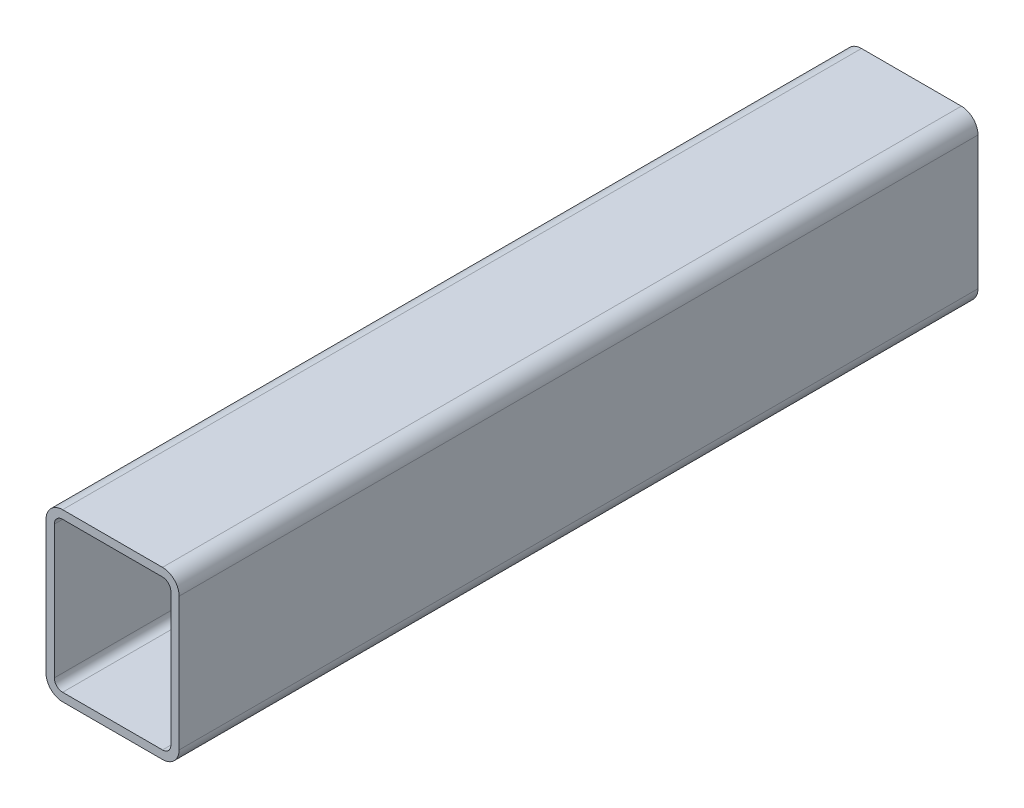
ISO-10303-21;
HEADER;
FILE_DESCRIPTION(('STEP AP214'),'2;1');
FILE_NAME('part.step','',(''),(''),'','','');
FILE_SCHEMA(('AUTOMOTIVE_DESIGN { 1 0 10303 214 1 1 1 1 }'));
ENDSEC;
DATA;
#1=APPLICATION_CONTEXT('core data for automotive mechanical design processes');
#2=APPLICATION_PROTOCOL_DEFINITION('international standard','automotive_design',2000,#1);
#3=PRODUCT_CONTEXT('',#1,'mechanical');
#4=PRODUCT('Part','Part','',(#3));
#5=PRODUCT_RELATED_PRODUCT_CATEGORY('part','',(#4));
#6=PRODUCT_DEFINITION_FORMATION('','',#4);
#7=PRODUCT_DEFINITION_CONTEXT('part definition',#1,'design');
#8=PRODUCT_DEFINITION('design','',#6,#7);
#9=PRODUCT_DEFINITION_SHAPE('','',#8);
#10=(LENGTH_UNIT() NAMED_UNIT(*) SI_UNIT(.MILLI.,.METRE.));
#11=(NAMED_UNIT(*) PLANE_ANGLE_UNIT() SI_UNIT($,.RADIAN.));
#12=(NAMED_UNIT(*) SI_UNIT($,.STERADIAN.) SOLID_ANGLE_UNIT());
#13=UNCERTAINTY_MEASURE_WITH_UNIT(LENGTH_MEASURE(1.E-05),#10,'distance_accuracy_value','');
#14=(GEOMETRIC_REPRESENTATION_CONTEXT(3) GLOBAL_UNCERTAINTY_ASSIGNED_CONTEXT((#13)) GLOBAL_UNIT_ASSIGNED_CONTEXT((#10,
#11,#12)) REPRESENTATION_CONTEXT('',''));
#15=CARTESIAN_POINT('',(0.,0.,0.));
#16=DIRECTION('',(0.,0.,1.));
#17=DIRECTION('',(1.,0.,0.));
#18=AXIS2_PLACEMENT_3D('',#15,#16,#17);
#19=CARTESIAN_POINT('',(6.35,57.15,304.8));
#20=DIRECTION('',(0.,0.,1.));
#21=DIRECTION('',(1.,0.,0.));
#22=AXIS2_PLACEMENT_3D('',#19,#20,#21);
#23=PLANE('',#22);
#24=CARTESIAN_POINT('',(6.35,57.15,304.8));
#25=DIRECTION('',(0.,0.,1.));
#26=DIRECTION('',(1.,0.,0.));
#27=AXIS2_PLACEMENT_3D('',#24,#25,#26);
#28=CIRCLE('',#27,6.35);
#29=CARTESIAN_POINT('',(6.35,63.5,304.8));
#30=VERTEX_POINT('',#29);
#31=CARTESIAN_POINT('',(0.,57.15,304.8));
#32=VERTEX_POINT('',#31);
#33=EDGE_CURVE('E211',#30,#32,#28,.T.);
#34=ORIENTED_EDGE('',*,*,#33,.T.);
#35=DIRECTION('',(0.,-1.,0.));
#36=VECTOR('',#35,1.);
#37=CARTESIAN_POINT('',(0.,6.35,304.8));
#38=LINE('',#37,#36);
#39=CARTESIAN_POINT('',(0.,6.35,304.8));
#40=VERTEX_POINT('',#39);
#41=EDGE_CURVE('E214',#32,#40,#38,.T.);
#42=ORIENTED_EDGE('',*,*,#41,.T.);
#43=CARTESIAN_POINT('',(6.35,6.35,304.8));
#44=DIRECTION('',(0.,0.,1.));
#45=DIRECTION('',(1.,0.,0.));
#46=AXIS2_PLACEMENT_3D('',#43,#44,#45);
#47=CIRCLE('',#46,6.35);
#48=CARTESIAN_POINT('',(6.35,0.,304.8));
#49=VERTEX_POINT('',#48);
#50=EDGE_CURVE('E217',#40,#49,#47,.T.);
#51=ORIENTED_EDGE('',*,*,#50,.T.);
#52=DIRECTION('',(1.,0.,0.));
#53=VECTOR('',#52,1.);
#54=CARTESIAN_POINT('',(44.45,0.,304.8));
#55=LINE('',#54,#53);
#56=CARTESIAN_POINT('',(44.45,0.,304.8));
#57=VERTEX_POINT('',#56);
#58=EDGE_CURVE('E219',#49,#57,#55,.T.);
#59=ORIENTED_EDGE('',*,*,#58,.T.);
#60=CARTESIAN_POINT('',(44.45,6.35,304.8));
#61=DIRECTION('',(0.,0.,1.));
#62=DIRECTION('',(1.,0.,0.));
#63=AXIS2_PLACEMENT_3D('',#60,#61,#62);
#64=CIRCLE('',#63,6.35);
#65=CARTESIAN_POINT('',(50.8,6.35,304.8));
#66=VERTEX_POINT('',#65);
#67=EDGE_CURVE('E221',#57,#66,#64,.T.);
#68=ORIENTED_EDGE('',*,*,#67,.T.);
#69=DIRECTION('',(0.,1.,0.));
#70=VECTOR('',#69,1.);
#71=CARTESIAN_POINT('',(50.8,57.15,304.8));
#72=LINE('',#71,#70);
#73=CARTESIAN_POINT('',(50.8,57.15,304.8));
#74=VERTEX_POINT('',#73);
#75=EDGE_CURVE('E223',#66,#74,#72,.T.);
#76=ORIENTED_EDGE('',*,*,#75,.T.);
#77=CARTESIAN_POINT('',(44.45,57.15,304.8));
#78=DIRECTION('',(0.,0.,1.));
#79=DIRECTION('',(1.,0.,0.));
#80=AXIS2_PLACEMENT_3D('',#77,#78,#79);
#81=CIRCLE('',#80,6.35);
#82=CARTESIAN_POINT('',(44.45,63.5,304.8));
#83=VERTEX_POINT('',#82);
#84=EDGE_CURVE('E225',#74,#83,#81,.T.);
#85=ORIENTED_EDGE('',*,*,#84,.T.);
#86=DIRECTION('',(-1.,0.,0.));
#87=VECTOR('',#86,1.);
#88=CARTESIAN_POINT('',(6.35,63.5,304.8));
#89=LINE('',#88,#87);
#90=EDGE_CURVE('E227',#83,#30,#89,.T.);
#91=ORIENTED_EDGE('',*,*,#90,.T.);
#92=EDGE_LOOP('',(#34,#42,#51,#59,#68,#76,#85,#91));
#93=FACE_BOUND('',#92,.T.);
#94=DIRECTION('',(0.,-1.,0.));
#95=VECTOR('',#94,1.);
#96=CARTESIAN_POINT('',(3.175,6.35,304.8));
#97=LINE('',#96,#95);
#98=CARTESIAN_POINT('',(3.175,57.15,304.8));
#99=VERTEX_POINT('',#98);
#100=CARTESIAN_POINT('',(3.175,6.35,304.8));
#101=VERTEX_POINT('',#100);
#102=EDGE_CURVE('E154',#99,#101,#97,.T.);
#103=ORIENTED_EDGE('',*,*,#102,.F.);
#104=CARTESIAN_POINT('',(6.35,57.15,304.8));
#105=DIRECTION('',(0.,0.,1.));
#106=DIRECTION('',(1.,0.,0.));
#107=AXIS2_PLACEMENT_3D('',#104,#105,#106);
#108=CIRCLE('',#107,3.17499999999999);
#109=CARTESIAN_POINT('',(6.35,60.325,304.8));
#110=VERTEX_POINT('',#109);
#111=EDGE_CURVE('E146',#110,#99,#108,.T.);
#112=ORIENTED_EDGE('',*,*,#111,.F.);
#113=DIRECTION('',(-1.,0.,0.));
#114=VECTOR('',#113,1.);
#115=CARTESIAN_POINT('',(6.35,60.325,304.8));
#116=LINE('',#115,#114);
#117=CARTESIAN_POINT('',(44.45,60.325,304.8));
#118=VERTEX_POINT('',#117);
#119=EDGE_CURVE('E179',#118,#110,#116,.T.);
#120=ORIENTED_EDGE('',*,*,#119,.F.);
#121=CARTESIAN_POINT('',(44.45,57.15,304.8));
#122=DIRECTION('',(0.,0.,1.));
#123=DIRECTION('',(1.,0.,0.));
#124=AXIS2_PLACEMENT_3D('',#121,#122,#123);
#125=CIRCLE('',#124,3.17499999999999);
#126=CARTESIAN_POINT('',(47.625,57.15,304.8));
#127=VERTEX_POINT('',#126);
#128=EDGE_CURVE('E177',#127,#118,#125,.T.);
#129=ORIENTED_EDGE('',*,*,#128,.F.);
#130=DIRECTION('',(0.,1.,0.));
#131=VECTOR('',#130,1.);
#132=CARTESIAN_POINT('',(47.625,57.15,304.8));
#133=LINE('',#132,#131);
#134=CARTESIAN_POINT('',(47.625,6.35,304.8));
#135=VERTEX_POINT('',#134);
#136=EDGE_CURVE('E175',#135,#127,#133,.T.);
#137=ORIENTED_EDGE('',*,*,#136,.F.);
#138=CARTESIAN_POINT('',(44.45,6.35,304.8));
#139=DIRECTION('',(0.,0.,1.));
#140=DIRECTION('',(1.,0.,0.));
#141=AXIS2_PLACEMENT_3D('',#138,#139,#140);
#142=CIRCLE('',#141,3.175);
#143=CARTESIAN_POINT('',(44.45,3.175,304.8));
#144=VERTEX_POINT('',#143);
#145=EDGE_CURVE('E173',#144,#135,#142,.T.);
#146=ORIENTED_EDGE('',*,*,#145,.F.);
#147=DIRECTION('',(1.,0.,0.));
#148=VECTOR('',#147,1.);
#149=CARTESIAN_POINT('',(44.45,3.175,304.8));
#150=LINE('',#149,#148);
#151=CARTESIAN_POINT('',(6.35,3.175,304.8));
#152=VERTEX_POINT('',#151);
#153=EDGE_CURVE('E169',#152,#144,#150,.T.);
#154=ORIENTED_EDGE('',*,*,#153,.F.);
#155=CARTESIAN_POINT('',(6.35,6.35,304.8));
#156=DIRECTION('',(0.,0.,1.));
#157=DIRECTION('',(1.,0.,0.));
#158=AXIS2_PLACEMENT_3D('',#155,#156,#157);
#159=CIRCLE('',#158,3.175);
#160=EDGE_CURVE('E167',#101,#152,#159,.T.);
#161=ORIENTED_EDGE('',*,*,#160,.F.);
#162=EDGE_LOOP('',(#103,#112,#120,#129,#137,#146,#154,#161));
#163=FACE_BOUND('',#162,.T.);
#164=ADVANCED_FACE('F33',(#93,#163),#23,.T.);
#165=CARTESIAN_POINT('',(6.35,57.15,0.));
#166=DIRECTION('',(0.,0.,1.));
#167=DIRECTION('',(1.,0.,0.));
#168=AXIS2_PLACEMENT_3D('',#165,#166,#167);
#169=PLANE('',#168);
#170=CARTESIAN_POINT('',(6.35,57.15,0.));
#171=DIRECTION('',(0.,0.,1.));
#172=DIRECTION('',(1.,0.,0.));
#173=AXIS2_PLACEMENT_3D('',#170,#171,#172);
#174=CIRCLE('',#173,6.35);
#175=CARTESIAN_POINT('',(6.35,63.5,0.));
#176=VERTEX_POINT('',#175);
#177=CARTESIAN_POINT('',(0.,57.15,0.));
#178=VERTEX_POINT('',#177);
#179=EDGE_CURVE('E162',#176,#178,#174,.T.);
#180=ORIENTED_EDGE('',*,*,#179,.F.);
#181=DIRECTION('',(-1.,0.,0.));
#182=VECTOR('',#181,1.);
#183=CARTESIAN_POINT('',(6.35,63.5,0.));
#184=LINE('',#183,#182);
#185=CARTESIAN_POINT('',(44.45,63.5,0.));
#186=VERTEX_POINT('',#185);
#187=EDGE_CURVE('E215',#186,#176,#184,.T.);
#188=ORIENTED_EDGE('',*,*,#187,.F.);
#189=CARTESIAN_POINT('',(44.45,57.15,0.));
#190=DIRECTION('',(0.,0.,1.));
#191=DIRECTION('',(1.,0.,0.));
#192=AXIS2_PLACEMENT_3D('',#189,#190,#191);
#193=CIRCLE('',#192,6.35);
#194=CARTESIAN_POINT('',(50.8,57.15,0.));
#195=VERTEX_POINT('',#194);
#196=EDGE_CURVE('E242',#195,#186,#193,.T.);
#197=ORIENTED_EDGE('',*,*,#196,.F.);
#198=DIRECTION('',(0.,1.,0.));
#199=VECTOR('',#198,1.);
#200=CARTESIAN_POINT('',(50.8,57.15,0.));
#201=LINE('',#200,#199);
#202=CARTESIAN_POINT('',(50.8,6.35,0.));
#203=VERTEX_POINT('',#202);
#204=EDGE_CURVE('E240',#203,#195,#201,.T.);
#205=ORIENTED_EDGE('',*,*,#204,.F.);
#206=CARTESIAN_POINT('',(44.45,6.35,0.));
#207=DIRECTION('',(0.,0.,1.));
#208=DIRECTION('',(1.,0.,0.));
#209=AXIS2_PLACEMENT_3D('',#206,#207,#208);
#210=CIRCLE('',#209,6.35);
#211=CARTESIAN_POINT('',(44.45,0.,0.));
#212=VERTEX_POINT('',#211);
#213=EDGE_CURVE('E238',#212,#203,#210,.T.);
#214=ORIENTED_EDGE('',*,*,#213,.F.);
#215=DIRECTION('',(1.,0.,0.));
#216=VECTOR('',#215,1.);
#217=CARTESIAN_POINT('',(44.45,0.,0.));
#218=LINE('',#217,#216);
#219=CARTESIAN_POINT('',(6.35,0.,0.));
#220=VERTEX_POINT('',#219);
#221=EDGE_CURVE('E236',#220,#212,#218,.T.);
#222=ORIENTED_EDGE('',*,*,#221,.F.);
#223=CARTESIAN_POINT('',(6.35,6.35,0.));
#224=DIRECTION('',(0.,0.,1.));
#225=DIRECTION('',(1.,0.,0.));
#226=AXIS2_PLACEMENT_3D('',#223,#224,#225);
#227=CIRCLE('',#226,6.35);
#228=CARTESIAN_POINT('',(0.,6.35,0.));
#229=VERTEX_POINT('',#228);
#230=EDGE_CURVE('E234',#229,#220,#227,.T.);
#231=ORIENTED_EDGE('',*,*,#230,.F.);
#232=DIRECTION('',(0.,-1.,0.));
#233=VECTOR('',#232,1.);
#234=CARTESIAN_POINT('',(0.,6.35,0.));
#235=LINE('',#234,#233);
#236=EDGE_CURVE('E232',#178,#229,#235,.T.);
#237=ORIENTED_EDGE('',*,*,#236,.F.);
#238=EDGE_LOOP('',(#180,#188,#197,#205,#214,#222,#231,#237));
#239=FACE_BOUND('',#238,.T.);
#240=CARTESIAN_POINT('',(6.35,57.15,0.));
#241=DIRECTION('',(0.,0.,1.));
#242=DIRECTION('',(1.,0.,0.));
#243=AXIS2_PLACEMENT_3D('',#240,#241,#242);
#244=CIRCLE('',#243,3.17499999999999);
#245=CARTESIAN_POINT('',(6.35,60.325,0.));
#246=VERTEX_POINT('',#245);
#247=CARTESIAN_POINT('',(3.175,57.15,0.));
#248=VERTEX_POINT('',#247);
#249=EDGE_CURVE('E56',#246,#248,#244,.T.);
#250=ORIENTED_EDGE('',*,*,#249,.T.);
#251=DIRECTION('',(0.,-1.,0.));
#252=VECTOR('',#251,1.);
#253=CARTESIAN_POINT('',(3.175,6.35,0.));
#254=LINE('',#253,#252);
#255=CARTESIAN_POINT('',(3.175,6.35,0.));
#256=VERTEX_POINT('',#255);
#257=EDGE_CURVE('E161',#248,#256,#254,.T.);
#258=ORIENTED_EDGE('',*,*,#257,.T.);
#259=CARTESIAN_POINT('',(6.35,6.35,0.));
#260=DIRECTION('',(0.,0.,1.));
#261=DIRECTION('',(1.,0.,0.));
#262=AXIS2_PLACEMENT_3D('',#259,#260,#261);
#263=CIRCLE('',#262,3.175);
#264=CARTESIAN_POINT('',(6.35,3.175,0.));
#265=VERTEX_POINT('',#264);
#266=EDGE_CURVE('E183',#256,#265,#263,.T.);
#267=ORIENTED_EDGE('',*,*,#266,.T.);
#268=DIRECTION('',(1.,0.,0.));
#269=VECTOR('',#268,1.);
#270=CARTESIAN_POINT('',(44.45,3.175,0.));
#271=LINE('',#270,#269);
#272=CARTESIAN_POINT('',(44.45,3.175,0.));
#273=VERTEX_POINT('',#272);
#274=EDGE_CURVE('E186',#265,#273,#271,.T.);
#275=ORIENTED_EDGE('',*,*,#274,.T.);
#276=CARTESIAN_POINT('',(44.45,6.35,0.));
#277=DIRECTION('',(0.,0.,1.));
#278=DIRECTION('',(1.,0.,0.));
#279=AXIS2_PLACEMENT_3D('',#276,#277,#278);
#280=CIRCLE('',#279,3.175);
#281=CARTESIAN_POINT('',(47.625,6.35,0.));
#282=VERTEX_POINT('',#281);
#283=EDGE_CURVE('E189',#273,#282,#280,.T.);
#284=ORIENTED_EDGE('',*,*,#283,.T.);
#285=DIRECTION('',(0.,1.,0.));
#286=VECTOR('',#285,1.);
#287=CARTESIAN_POINT('',(47.625,57.15,0.));
#288=LINE('',#287,#286);
#289=CARTESIAN_POINT('',(47.625,57.15,0.));
#290=VERTEX_POINT('',#289);
#291=EDGE_CURVE('E192',#282,#290,#288,.T.);
#292=ORIENTED_EDGE('',*,*,#291,.T.);
#293=CARTESIAN_POINT('',(44.45,57.15,0.));
#294=DIRECTION('',(0.,0.,1.));
#295=DIRECTION('',(1.,0.,0.));
#296=AXIS2_PLACEMENT_3D('',#293,#294,#295);
#297=CIRCLE('',#296,3.17499999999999);
#298=CARTESIAN_POINT('',(44.45,60.325,0.));
#299=VERTEX_POINT('',#298);
#300=EDGE_CURVE('E195',#290,#299,#297,.T.);
#301=ORIENTED_EDGE('',*,*,#300,.T.);
#302=DIRECTION('',(-1.,0.,0.));
#303=VECTOR('',#302,1.);
#304=CARTESIAN_POINT('',(6.35,60.325,0.));
#305=LINE('',#304,#303);
#306=EDGE_CURVE('E155',#299,#246,#305,.T.);
#307=ORIENTED_EDGE('',*,*,#306,.T.);
#308=EDGE_LOOP('',(#250,#258,#267,#275,#284,#292,#301,#307));
#309=FACE_BOUND('',#308,.T.);
#310=ADVANCED_FACE('F272',(#239,#309),#169,.F.);
#311=CARTESIAN_POINT('',(6.35,57.15,304.8));
#312=DIRECTION('',(0.,0.,-1.));
#313=DIRECTION('',(-1.,0.,0.));
#314=AXIS2_PLACEMENT_3D('',#311,#312,#313);
#315=CYLINDRICAL_SURFACE('',#314,6.35);
#316=ORIENTED_EDGE('',*,*,#179,.T.);
#317=DIRECTION('',(0.,0.,-1.));
#318=VECTOR('',#317,1.);
#319=CARTESIAN_POINT('',(0.,57.15,304.8));
#320=LINE('',#319,#318);
#321=EDGE_CURVE('E11',#32,#178,#320,.T.);
#322=ORIENTED_EDGE('',*,*,#321,.F.);
#323=ORIENTED_EDGE('',*,*,#33,.F.);
#324=DIRECTION('',(0.,0.,-1.));
#325=VECTOR('',#324,1.);
#326=CARTESIAN_POINT('',(6.35,63.5,304.8));
#327=LINE('',#326,#325);
#328=EDGE_CURVE('E229',#30,#176,#327,.T.);
#329=ORIENTED_EDGE('',*,*,#328,.T.);
#330=EDGE_LOOP('',(#316,#322,#323,#329));
#331=FACE_BOUND('',#330,.T.);
#332=ADVANCED_FACE('F35',(#331),#315,.T.);
#333=CARTESIAN_POINT('',(0.,6.35,304.8));
#334=DIRECTION('',(1.,0.,0.));
#335=DIRECTION('',(0.,0.,-1.));
#336=AXIS2_PLACEMENT_3D('',#333,#334,#335);
#337=PLANE('',#336);
#338=ORIENTED_EDGE('',*,*,#236,.T.);
#339=DIRECTION('',(0.,0.,-1.));
#340=VECTOR('',#339,1.);
#341=CARTESIAN_POINT('',(0.,6.35,304.8));
#342=LINE('',#341,#340);
#343=EDGE_CURVE('E41',#40,#229,#342,.T.);
#344=ORIENTED_EDGE('',*,*,#343,.F.);
#345=ORIENTED_EDGE('',*,*,#41,.F.);
#346=ORIENTED_EDGE('',*,*,#321,.T.);
#347=EDGE_LOOP('',(#338,#344,#345,#346));
#348=FACE_BOUND('',#347,.T.);
#349=ADVANCED_FACE('F289',(#348),#337,.F.);
#350=CARTESIAN_POINT('',(6.35,6.35,304.8));
#351=DIRECTION('',(0.,0.,-1.));
#352=DIRECTION('',(-1.,0.,0.));
#353=AXIS2_PLACEMENT_3D('',#350,#351,#352);
#354=CYLINDRICAL_SURFACE('',#353,6.35);
#355=ORIENTED_EDGE('',*,*,#230,.T.);
#356=DIRECTION('',(0.,0.,-1.));
#357=VECTOR('',#356,1.);
#358=CARTESIAN_POINT('',(6.35,0.,304.8));
#359=LINE('',#358,#357);
#360=EDGE_CURVE('E259',#49,#220,#359,.T.);
#361=ORIENTED_EDGE('',*,*,#360,.F.);
#362=ORIENTED_EDGE('',*,*,#50,.F.);
#363=ORIENTED_EDGE('',*,*,#343,.T.);
#364=EDGE_LOOP('',(#355,#361,#362,#363));
#365=FACE_BOUND('',#364,.T.);
#366=ADVANCED_FACE('F266',(#365),#354,.T.);
#367=CARTESIAN_POINT('',(44.45,0.,304.8));
#368=DIRECTION('',(0.,1.,0.));
#369=DIRECTION('',(0.,0.,1.));
#370=AXIS2_PLACEMENT_3D('',#367,#368,#369);
#371=PLANE('',#370);
#372=ORIENTED_EDGE('',*,*,#221,.T.);
#373=DIRECTION('',(0.,0.,-1.));
#374=VECTOR('',#373,1.);
#375=CARTESIAN_POINT('',(44.45,0.,304.8));
#376=LINE('',#375,#374);
#377=EDGE_CURVE('E256',#57,#212,#376,.T.);
#378=ORIENTED_EDGE('',*,*,#377,.F.);
#379=ORIENTED_EDGE('',*,*,#58,.F.);
#380=ORIENTED_EDGE('',*,*,#360,.T.);
#381=EDGE_LOOP('',(#372,#378,#379,#380));
#382=FACE_BOUND('',#381,.T.);
#383=ADVANCED_FACE('F278',(#382),#371,.F.);
#384=CARTESIAN_POINT('',(44.45,6.35,304.8));
#385=DIRECTION('',(0.,0.,-1.));
#386=DIRECTION('',(-1.,0.,0.));
#387=AXIS2_PLACEMENT_3D('',#384,#385,#386);
#388=CYLINDRICAL_SURFACE('',#387,6.35);
#389=ORIENTED_EDGE('',*,*,#213,.T.);
#390=DIRECTION('',(0.,0.,-1.));
#391=VECTOR('',#390,1.);
#392=CARTESIAN_POINT('',(50.8,6.35,304.8));
#393=LINE('',#392,#391);
#394=EDGE_CURVE('E253',#66,#203,#393,.T.);
#395=ORIENTED_EDGE('',*,*,#394,.F.);
#396=ORIENTED_EDGE('',*,*,#67,.F.);
#397=ORIENTED_EDGE('',*,*,#377,.T.);
#398=EDGE_LOOP('',(#389,#395,#396,#397));
#399=FACE_BOUND('',#398,.T.);
#400=ADVANCED_FACE('F282',(#399),#388,.T.);
#401=CARTESIAN_POINT('',(50.8,57.15,304.8));
#402=DIRECTION('',(-1.,0.,0.));
#403=DIRECTION('',(0.,0.,1.));
#404=AXIS2_PLACEMENT_3D('',#401,#402,#403);
#405=PLANE('',#404);
#406=ORIENTED_EDGE('',*,*,#204,.T.);
#407=DIRECTION('',(0.,0.,-1.));
#408=VECTOR('',#407,1.);
#409=CARTESIAN_POINT('',(50.8,57.15,304.8));
#410=LINE('',#409,#408);
#411=EDGE_CURVE('E250',#74,#195,#410,.T.);
#412=ORIENTED_EDGE('',*,*,#411,.F.);
#413=ORIENTED_EDGE('',*,*,#75,.F.);
#414=ORIENTED_EDGE('',*,*,#394,.T.);
#415=EDGE_LOOP('',(#406,#412,#413,#414));
#416=FACE_BOUND('',#415,.T.);
#417=ADVANCED_FACE('F302',(#416),#405,.F.);
#418=CARTESIAN_POINT('',(44.45,57.15,304.8));
#419=DIRECTION('',(0.,0.,-1.));
#420=DIRECTION('',(-1.,0.,0.));
#421=AXIS2_PLACEMENT_3D('',#418,#419,#420);
#422=CYLINDRICAL_SURFACE('',#421,6.35);
#423=ORIENTED_EDGE('',*,*,#196,.T.);
#424=DIRECTION('',(0.,0.,-1.));
#425=VECTOR('',#424,1.);
#426=CARTESIAN_POINT('',(44.45,63.5,304.8));
#427=LINE('',#426,#425);
#428=EDGE_CURVE('E247',#83,#186,#427,.T.);
#429=ORIENTED_EDGE('',*,*,#428,.F.);
#430=ORIENTED_EDGE('',*,*,#84,.F.);
#431=ORIENTED_EDGE('',*,*,#411,.T.);
#432=EDGE_LOOP('',(#423,#429,#430,#431));
#433=FACE_BOUND('',#432,.T.);
#434=ADVANCED_FACE('F300',(#433),#422,.T.);
#435=CARTESIAN_POINT('',(6.35,63.5,304.8));
#436=DIRECTION('',(0.,-1.,0.));
#437=DIRECTION('',(0.,0.,-1.));
#438=AXIS2_PLACEMENT_3D('',#435,#436,#437);
#439=PLANE('',#438);
#440=ORIENTED_EDGE('',*,*,#187,.T.);
#441=ORIENTED_EDGE('',*,*,#328,.F.);
#442=ORIENTED_EDGE('',*,*,#90,.F.);
#443=ORIENTED_EDGE('',*,*,#428,.T.);
#444=EDGE_LOOP('',(#440,#441,#442,#443));
#445=FACE_BOUND('',#444,.T.);
#446=ADVANCED_FACE('F295',(#445),#439,.F.);
#447=CARTESIAN_POINT('',(6.35,57.15,304.8));
#448=DIRECTION('',(0.,0.,-1.));
#449=DIRECTION('',(-1.,0.,0.));
#450=AXIS2_PLACEMENT_3D('',#447,#448,#449);
#451=CYLINDRICAL_SURFACE('',#450,3.17499999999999);
#452=ORIENTED_EDGE('',*,*,#249,.F.);
#453=DIRECTION('',(0.,0.,-1.));
#454=VECTOR('',#453,1.);
#455=CARTESIAN_POINT('',(6.35,60.325,304.8));
#456=LINE('',#455,#454);
#457=EDGE_CURVE('E150',#110,#246,#456,.T.);
#458=ORIENTED_EDGE('',*,*,#457,.F.);
#459=ORIENTED_EDGE('',*,*,#111,.T.);
#460=DIRECTION('',(0.,0.,-1.));
#461=VECTOR('',#460,1.);
#462=CARTESIAN_POINT('',(3.175,57.15,304.8));
#463=LINE('',#462,#461);
#464=EDGE_CURVE('E149',#99,#248,#463,.T.);
#465=ORIENTED_EDGE('',*,*,#464,.T.);
#466=EDGE_LOOP('',(#452,#458,#459,#465));
#467=FACE_BOUND('',#466,.T.);
#468=ADVANCED_FACE('F148',(#467),#451,.F.);
#469=CARTESIAN_POINT('',(3.175,6.35,304.8));
#470=DIRECTION('',(1.,0.,0.));
#471=DIRECTION('',(0.,0.,-1.));
#472=AXIS2_PLACEMENT_3D('',#469,#470,#471);
#473=PLANE('',#472);
#474=ORIENTED_EDGE('',*,*,#257,.F.);
#475=ORIENTED_EDGE('',*,*,#464,.F.);
#476=ORIENTED_EDGE('',*,*,#102,.T.);
#477=DIRECTION('',(0.,0.,-1.));
#478=VECTOR('',#477,1.);
#479=CARTESIAN_POINT('',(3.175,6.35,304.8));
#480=LINE('',#479,#478);
#481=EDGE_CURVE('E163',#101,#256,#480,.T.);
#482=ORIENTED_EDGE('',*,*,#481,.T.);
#483=EDGE_LOOP('',(#474,#475,#476,#482));
#484=FACE_BOUND('',#483,.T.);
#485=ADVANCED_FACE('F158',(#484),#473,.T.);
#486=CARTESIAN_POINT('',(6.35,6.35,304.8));
#487=DIRECTION('',(0.,0.,-1.));
#488=DIRECTION('',(-1.,0.,0.));
#489=AXIS2_PLACEMENT_3D('',#486,#487,#488);
#490=CYLINDRICAL_SURFACE('',#489,3.175);
#491=ORIENTED_EDGE('',*,*,#266,.F.);
#492=ORIENTED_EDGE('',*,*,#481,.F.);
#493=ORIENTED_EDGE('',*,*,#160,.T.);
#494=DIRECTION('',(0.,0.,-1.));
#495=VECTOR('',#494,1.);
#496=CARTESIAN_POINT('',(6.35,3.175,304.8));
#497=LINE('',#496,#495);
#498=EDGE_CURVE('E208',#152,#265,#497,.T.);
#499=ORIENTED_EDGE('',*,*,#498,.T.);
#500=EDGE_LOOP('',(#491,#492,#493,#499));
#501=FACE_BOUND('',#500,.T.);
#502=ADVANCED_FACE('F327',(#501),#490,.F.);
#503=CARTESIAN_POINT('',(44.45,3.175,304.8));
#504=DIRECTION('',(0.,1.,0.));
#505=DIRECTION('',(0.,0.,1.));
#506=AXIS2_PLACEMENT_3D('',#503,#504,#505);
#507=PLANE('',#506);
#508=ORIENTED_EDGE('',*,*,#274,.F.);
#509=ORIENTED_EDGE('',*,*,#498,.F.);
#510=ORIENTED_EDGE('',*,*,#153,.T.);
#511=DIRECTION('',(0.,0.,-1.));
#512=VECTOR('',#511,1.);
#513=CARTESIAN_POINT('',(44.45,3.175,304.8));
#514=LINE('',#513,#512);
#515=EDGE_CURVE('E206',#144,#273,#514,.T.);
#516=ORIENTED_EDGE('',*,*,#515,.T.);
#517=EDGE_LOOP('',(#508,#509,#510,#516));
#518=FACE_BOUND('',#517,.T.);
#519=ADVANCED_FACE('F331',(#518),#507,.T.);
#520=CARTESIAN_POINT('',(44.45,6.35,304.8));
#521=DIRECTION('',(0.,0.,-1.));
#522=DIRECTION('',(-1.,0.,0.));
#523=AXIS2_PLACEMENT_3D('',#520,#521,#522);
#524=CYLINDRICAL_SURFACE('',#523,3.175);
#525=ORIENTED_EDGE('',*,*,#283,.F.);
#526=ORIENTED_EDGE('',*,*,#515,.F.);
#527=ORIENTED_EDGE('',*,*,#145,.T.);
#528=DIRECTION('',(0.,0.,-1.));
#529=VECTOR('',#528,1.);
#530=CARTESIAN_POINT('',(47.625,6.35,304.8));
#531=LINE('',#530,#529);
#532=EDGE_CURVE('E204',#135,#282,#531,.T.);
#533=ORIENTED_EDGE('',*,*,#532,.T.);
#534=EDGE_LOOP('',(#525,#526,#527,#533));
#535=FACE_BOUND('',#534,.T.);
#536=ADVANCED_FACE('F337',(#535),#524,.F.);
#537=CARTESIAN_POINT('',(47.625,57.15,304.8));
#538=DIRECTION('',(-1.,0.,0.));
#539=DIRECTION('',(0.,0.,1.));
#540=AXIS2_PLACEMENT_3D('',#537,#538,#539);
#541=PLANE('',#540);
#542=ORIENTED_EDGE('',*,*,#291,.F.);
#543=ORIENTED_EDGE('',*,*,#532,.F.);
#544=ORIENTED_EDGE('',*,*,#136,.T.);
#545=DIRECTION('',(0.,0.,-1.));
#546=VECTOR('',#545,1.);
#547=CARTESIAN_POINT('',(47.625,57.15,304.8));
#548=LINE('',#547,#546);
#549=EDGE_CURVE('E202',#127,#290,#548,.T.);
#550=ORIENTED_EDGE('',*,*,#549,.T.);
#551=EDGE_LOOP('',(#542,#543,#544,#550));
#552=FACE_BOUND('',#551,.T.);
#553=ADVANCED_FACE('F341',(#552),#541,.T.);
#554=CARTESIAN_POINT('',(44.45,57.15,304.8));
#555=DIRECTION('',(0.,0.,-1.));
#556=DIRECTION('',(-1.,0.,0.));
#557=AXIS2_PLACEMENT_3D('',#554,#555,#556);
#558=CYLINDRICAL_SURFACE('',#557,3.17499999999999);
#559=ORIENTED_EDGE('',*,*,#300,.F.);
#560=ORIENTED_EDGE('',*,*,#549,.F.);
#561=ORIENTED_EDGE('',*,*,#128,.T.);
#562=DIRECTION('',(0.,0.,-1.));
#563=VECTOR('',#562,1.);
#564=CARTESIAN_POINT('',(44.45,60.325,304.8));
#565=LINE('',#564,#563);
#566=EDGE_CURVE('E48',#118,#299,#565,.T.);
#567=ORIENTED_EDGE('',*,*,#566,.T.);
#568=EDGE_LOOP('',(#559,#560,#561,#567));
#569=FACE_BOUND('',#568,.T.);
#570=ADVANCED_FACE('F345',(#569),#558,.F.);
#571=CARTESIAN_POINT('',(6.35,60.325,304.8));
#572=DIRECTION('',(0.,-1.,0.));
#573=DIRECTION('',(0.,0.,-1.));
#574=AXIS2_PLACEMENT_3D('',#571,#572,#573);
#575=PLANE('',#574);
#576=ORIENTED_EDGE('',*,*,#306,.F.);
#577=ORIENTED_EDGE('',*,*,#566,.F.);
#578=ORIENTED_EDGE('',*,*,#119,.T.);
#579=ORIENTED_EDGE('',*,*,#457,.T.);
#580=EDGE_LOOP('',(#576,#577,#578,#579));
#581=FACE_BOUND('',#580,.T.);
#582=ADVANCED_FACE('F349',(#581),#575,.T.);
#583=CLOSED_SHELL('',(#164,#310,#332,#349,#366,#383,#400,#417,#434,#446,#468,#485,#502,#519,
#536,#553,#570,#582));
#584=MANIFOLD_SOLID_BREP('B2',#583);
#585=ADVANCED_BREP_SHAPE_REPRESENTATION('',(#18,#584),#14);
#586=SHAPE_DEFINITION_REPRESENTATION(#9,#585);
ENDSEC;
END-ISO-10303-21;
